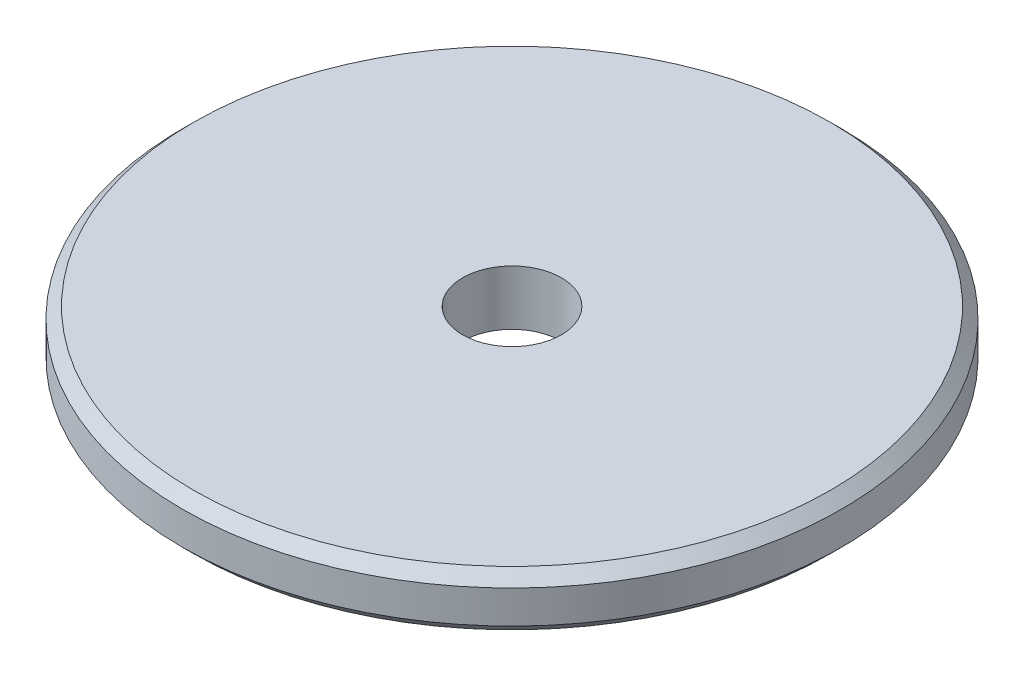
ISO-10303-21;
HEADER;
FILE_DESCRIPTION(('STEP AP214'),'2;1');
FILE_NAME('part.step','',(''),(''),'','','');
FILE_SCHEMA(('AUTOMOTIVE_DESIGN { 1 0 10303 214 1 1 1 1 }'));
ENDSEC;
DATA;
#1=APPLICATION_CONTEXT('core data for automotive mechanical design processes');
#2=APPLICATION_PROTOCOL_DEFINITION('international standard','automotive_design',2000,#1);
#3=PRODUCT_CONTEXT('',#1,'mechanical');
#4=PRODUCT('Part','Part','',(#3));
#5=PRODUCT_RELATED_PRODUCT_CATEGORY('part','',(#4));
#6=PRODUCT_DEFINITION_FORMATION('','',#4);
#7=PRODUCT_DEFINITION_CONTEXT('part definition',#1,'design');
#8=PRODUCT_DEFINITION('design','',#6,#7);
#9=PRODUCT_DEFINITION_SHAPE('','',#8);
#10=(LENGTH_UNIT() NAMED_UNIT(*) SI_UNIT(.MILLI.,.METRE.));
#11=(NAMED_UNIT(*) PLANE_ANGLE_UNIT() SI_UNIT($,.RADIAN.));
#12=(NAMED_UNIT(*) SI_UNIT($,.STERADIAN.) SOLID_ANGLE_UNIT());
#13=UNCERTAINTY_MEASURE_WITH_UNIT(LENGTH_MEASURE(1.E-05),#10,'distance_accuracy_value','');
#14=(GEOMETRIC_REPRESENTATION_CONTEXT(3) GLOBAL_UNCERTAINTY_ASSIGNED_CONTEXT((#13)) GLOBAL_UNIT_ASSIGNED_CONTEXT((#10,
#11,#12)) REPRESENTATION_CONTEXT('',''));
#15=CARTESIAN_POINT('',(0.,0.,0.));
#16=DIRECTION('',(0.,0.,1.));
#17=DIRECTION('',(1.,0.,0.));
#18=AXIS2_PLACEMENT_3D('',#15,#16,#17);
#19=CARTESIAN_POINT('',(0.,5.,0.));
#20=DIRECTION('',(0.,1.,0.));
#21=DIRECTION('',(0.,0.,1.));
#22=AXIS2_PLACEMENT_3D('',#19,#20,#21);
#23=PLANE('',#22);
#24=CARTESIAN_POINT('',(0.,5.,0.));
#25=DIRECTION('',(0.,1.,0.));
#26=DIRECTION('',(0.,0.,1.));
#27=AXIS2_PLACEMENT_3D('',#24,#25,#26);
#28=CIRCLE('',#27,29.);
#29=CARTESIAN_POINT('',(0.,5.,29.));
#30=VERTEX_POINT('',#29);
#31=EDGE_CURVE('E10',#30,#30,#28,.T.);
#32=ORIENTED_EDGE('',*,*,#31,.T.);
#33=EDGE_LOOP('',(#32));
#34=FACE_BOUND('',#33,.T.);
#35=CARTESIAN_POINT('',(0.,5.,0.));
#36=DIRECTION('',(0.,1.,0.));
#37=DIRECTION('',(0.,0.,1.));
#38=AXIS2_PLACEMENT_3D('',#35,#36,#37);
#39=CIRCLE('',#38,4.5);
#40=CARTESIAN_POINT('',(0.,5.,4.5));
#41=VERTEX_POINT('',#40);
#42=EDGE_CURVE('E49',#41,#41,#39,.T.);
#43=ORIENTED_EDGE('',*,*,#42,.F.);
#44=EDGE_LOOP('',(#43));
#45=FACE_BOUND('',#44,.T.);
#46=ADVANCED_FACE('F29',(#34,#45),#23,.T.);
#47=CARTESIAN_POINT('',(0.,0.,0.));
#48=DIRECTION('',(0.,1.,0.));
#49=DIRECTION('',(0.,0.,1.));
#50=AXIS2_PLACEMENT_3D('',#47,#48,#49);
#51=PLANE('',#50);
#52=CARTESIAN_POINT('',(0.,0.,0.));
#53=DIRECTION('',(0.,1.,0.));
#54=DIRECTION('',(0.,0.,1.));
#55=AXIS2_PLACEMENT_3D('',#52,#53,#54);
#56=CIRCLE('',#55,29.);
#57=CARTESIAN_POINT('',(0.,0.,29.));
#58=VERTEX_POINT('',#57);
#59=EDGE_CURVE('E36',#58,#58,#56,.F.);
#60=ORIENTED_EDGE('',*,*,#59,.T.);
#61=EDGE_LOOP('',(#60));
#62=FACE_BOUND('',#61,.T.);
#63=CARTESIAN_POINT('',(0.,0.,0.));
#64=DIRECTION('',(0.,1.,0.));
#65=DIRECTION('',(0.,0.,1.));
#66=AXIS2_PLACEMENT_3D('',#63,#64,#65);
#67=CIRCLE('',#66,4.5);
#68=CARTESIAN_POINT('',(0.,0.,4.5));
#69=VERTEX_POINT('',#68);
#70=EDGE_CURVE('E50',#69,#69,#67,.T.);
#71=ORIENTED_EDGE('',*,*,#70,.T.);
#72=EDGE_LOOP('',(#71));
#73=FACE_BOUND('',#72,.T.);
#74=ADVANCED_FACE('F60',(#62,#73),#51,.F.);
#75=CARTESIAN_POINT('',(0.,5.,0.));
#76=DIRECTION('',(0.,-1.,0.));
#77=DIRECTION('',(0.,0.,-1.));
#78=AXIS2_PLACEMENT_3D('',#75,#76,#77);
#79=CYLINDRICAL_SURFACE('',#78,30.);
#80=CARTESIAN_POINT('',(0.,0.999999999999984,0.));
#81=DIRECTION('',(0.,1.,0.));
#82=DIRECTION('',(0.,0.,1.));
#83=AXIS2_PLACEMENT_3D('',#80,#81,#82);
#84=CIRCLE('',#83,30.);
#85=CARTESIAN_POINT('',(0.,0.999999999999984,30.));
#86=VERTEX_POINT('',#85);
#87=EDGE_CURVE('E40',#86,#86,#84,.T.);
#88=ORIENTED_EDGE('',*,*,#87,.T.);
#89=EDGE_LOOP('',(#88));
#90=FACE_BOUND('',#89,.T.);
#91=CARTESIAN_POINT('',(0.,4.,0.));
#92=DIRECTION('',(0.,1.,0.));
#93=DIRECTION('',(0.,0.,1.));
#94=AXIS2_PLACEMENT_3D('',#91,#92,#93);
#95=CIRCLE('',#94,30.);
#96=CARTESIAN_POINT('',(0.,4.,30.));
#97=VERTEX_POINT('',#96);
#98=EDGE_CURVE('E44',#97,#97,#95,.F.);
#99=ORIENTED_EDGE('',*,*,#98,.T.);
#100=EDGE_LOOP('',(#99));
#101=FACE_BOUND('',#100,.T.);
#102=ADVANCED_FACE('F65',(#90,#101),#79,.T.);
#103=CARTESIAN_POINT('',(0.,5.,0.));
#104=DIRECTION('',(0.,-1.,0.));
#105=DIRECTION('',(0.,0.,-1.));
#106=AXIS2_PLACEMENT_3D('',#103,#104,#105);
#107=CYLINDRICAL_SURFACE('',#106,4.5);
#108=ORIENTED_EDGE('',*,*,#42,.T.);
#109=EDGE_LOOP('',(#108));
#110=FACE_BOUND('',#109,.T.);
#111=ORIENTED_EDGE('',*,*,#70,.F.);
#112=EDGE_LOOP('',(#111));
#113=FACE_BOUND('',#112,.T.);
#114=ADVANCED_FACE('F56',(#110,#113),#107,.F.);
#115=CARTESIAN_POINT('',(0.,0.999999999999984,0.));
#116=DIRECTION('',(0.,1.,0.));
#117=DIRECTION('',(0.,0.,1.));
#118=AXIS2_PLACEMENT_3D('',#115,#116,#117);
#119=CONICAL_SURFACE('',#118,30.,0.78539816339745);
#120=ORIENTED_EDGE('',*,*,#59,.F.);
#121=EDGE_LOOP('',(#120));
#122=FACE_BOUND('',#121,.T.);
#123=ORIENTED_EDGE('',*,*,#87,.F.);
#124=EDGE_LOOP('',(#123));
#125=FACE_BOUND('',#124,.T.);
#126=ADVANCED_FACE('F71',(#122,#125),#119,.T.);
#127=CARTESIAN_POINT('',(0.,5.,0.));
#128=DIRECTION('',(0.,-1.,0.));
#129=DIRECTION('',(0.,0.,-1.));
#130=AXIS2_PLACEMENT_3D('',#127,#128,#129);
#131=CONICAL_SURFACE('',#130,29.,0.785398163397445);
#132=ORIENTED_EDGE('',*,*,#98,.F.);
#133=EDGE_LOOP('',(#132));
#134=FACE_BOUND('',#133,.T.);
#135=ORIENTED_EDGE('',*,*,#31,.F.);
#136=EDGE_LOOP('',(#135));
#137=FACE_BOUND('',#136,.T.);
#138=ADVANCED_FACE('F31',(#134,#137),#131,.T.);
#139=CLOSED_SHELL('',(#46,#74,#102,#114,#126,#138));
#140=MANIFOLD_SOLID_BREP('B2',#139);
#141=ADVANCED_BREP_SHAPE_REPRESENTATION('',(#18,#140),#14);
#142=SHAPE_DEFINITION_REPRESENTATION(#9,#141);
ENDSEC;
END-ISO-10303-21;
